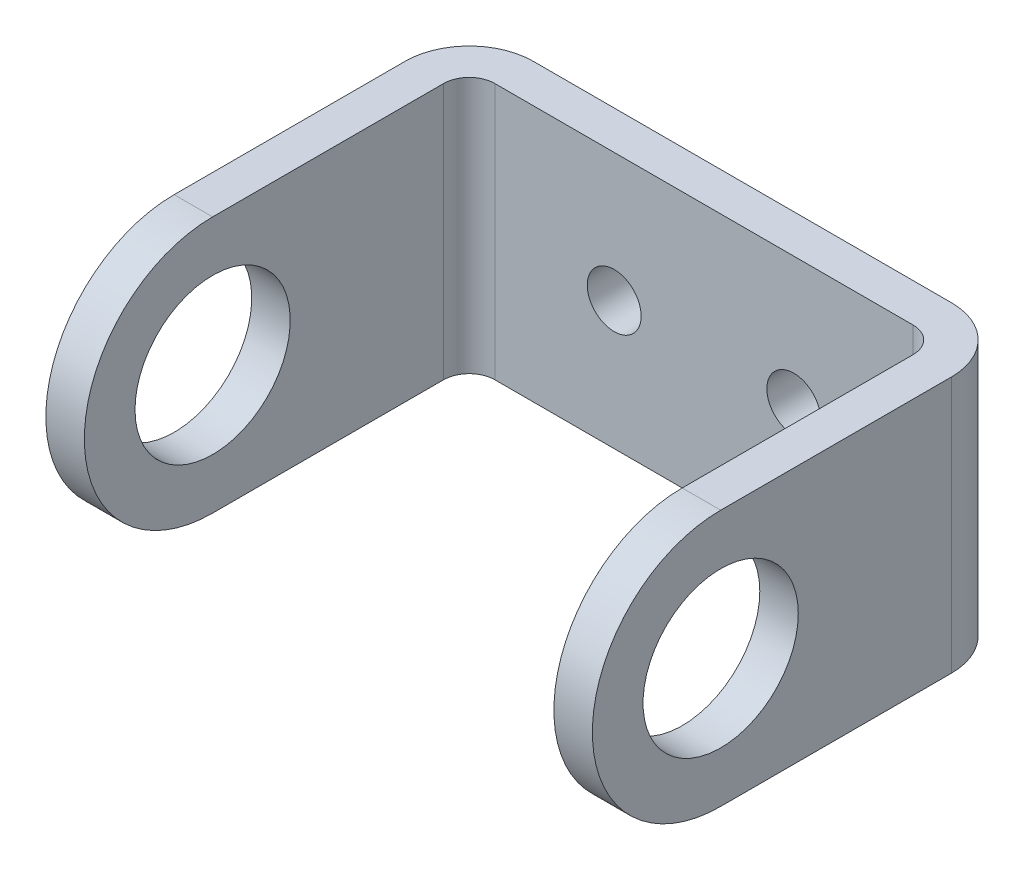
ISO-10303-21;
HEADER;
FILE_DESCRIPTION(('STEP AP214'),'2;1');
FILE_NAME('part.step','',(''),(''),'','','');
FILE_SCHEMA(('AUTOMOTIVE_DESIGN { 1 0 10303 214 1 1 1 1 }'));
ENDSEC;
DATA;
#1=APPLICATION_CONTEXT('core data for automotive mechanical design processes');
#2=APPLICATION_PROTOCOL_DEFINITION('international standard','automotive_design',2000,#1);
#3=PRODUCT_CONTEXT('',#1,'mechanical');
#4=PRODUCT('Part','Part','',(#3));
#5=PRODUCT_RELATED_PRODUCT_CATEGORY('part','',(#4));
#6=PRODUCT_DEFINITION_FORMATION('','',#4);
#7=PRODUCT_DEFINITION_CONTEXT('part definition',#1,'design');
#8=PRODUCT_DEFINITION('design','',#6,#7);
#9=PRODUCT_DEFINITION_SHAPE('','',#8);
#10=(LENGTH_UNIT() NAMED_UNIT(*) SI_UNIT(.MILLI.,.METRE.));
#11=(NAMED_UNIT(*) PLANE_ANGLE_UNIT() SI_UNIT($,.RADIAN.));
#12=(NAMED_UNIT(*) SI_UNIT($,.STERADIAN.) SOLID_ANGLE_UNIT());
#13=UNCERTAINTY_MEASURE_WITH_UNIT(LENGTH_MEASURE(1.E-05),#10,'distance_accuracy_value','');
#14=(GEOMETRIC_REPRESENTATION_CONTEXT(3) GLOBAL_UNCERTAINTY_ASSIGNED_CONTEXT((#13)) GLOBAL_UNIT_ASSIGNED_CONTEXT((#10,
#11,#12)) REPRESENTATION_CONTEXT('',''));
#15=CARTESIAN_POINT('',(0.,0.,0.));
#16=DIRECTION('',(0.,0.,1.));
#17=DIRECTION('',(1.,0.,0.));
#18=AXIS2_PLACEMENT_3D('',#15,#16,#17);
#19=CARTESIAN_POINT('',(18.3011064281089,0.,20.0011063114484));
#20=DIRECTION('',(-1.,0.,0.));
#21=DIRECTION('',(0.,0.,1.));
#22=AXIS2_PLACEMENT_3D('',#19,#20,#21);
#23=PLANE('',#22);
#24=CARTESIAN_POINT('',(18.3011064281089,0.,20.0011064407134));
#25=DIRECTION('',(1.,0.,0.));
#26=DIRECTION('',(0.,0.,-1.));
#27=AXIS2_PLACEMENT_3D('',#24,#25,#26);
#28=CIRCLE('',#27,6.05);
#29=CARTESIAN_POINT('',(18.3011064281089,0.,13.9511064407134));
#30=VERTEX_POINT('',#29);
#31=EDGE_CURVE('E254',#30,#30,#28,.T.);
#32=ORIENTED_EDGE('',*,*,#31,.T.);
#33=EDGE_LOOP('',(#32));
#34=FACE_BOUND('',#33,.T.);
#35=DIRECTION('',(0.,1.,0.));
#36=VECTOR('',#35,1.);
#37=CARTESIAN_POINT('',(18.301106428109,0.,2.));
#38=LINE('',#37,#36);
#39=CARTESIAN_POINT('',(18.301106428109,-10.,2.));
#40=VERTEX_POINT('',#39);
#41=CARTESIAN_POINT('',(18.301106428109,10.,2.));
#42=VERTEX_POINT('',#41);
#43=EDGE_CURVE('E142',#40,#42,#38,.T.);
#44=ORIENTED_EDGE('',*,*,#43,.F.);
#45=DIRECTION('',(0.,0.,1.));
#46=VECTOR('',#45,1.);
#47=CARTESIAN_POINT('',(18.3011064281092,-10.,-59.5988935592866));
#48=LINE('',#47,#46);
#49=CARTESIAN_POINT('',(18.3011064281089,-10.,20.0011064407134));
#50=VERTEX_POINT('',#49);
#51=EDGE_CURVE('E11',#40,#50,#48,.T.);
#52=ORIENTED_EDGE('',*,*,#51,.T.);
#53=CARTESIAN_POINT('',(18.3011064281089,0.,20.0011063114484));
#54=DIRECTION('',(-1.,0.,0.));
#55=DIRECTION('',(0.,0.,1.));
#56=AXIS2_PLACEMENT_3D('',#53,#54,#55);
#57=CIRCLE('',#56,10.);
#58=CARTESIAN_POINT('',(18.3011064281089,10.,20.0011064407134));
#59=VERTEX_POINT('',#58);
#60=EDGE_CURVE('E40',#50,#59,#57,.T.);
#61=ORIENTED_EDGE('',*,*,#60,.T.);
#62=DIRECTION('',(0.,0.,-1.));
#63=VECTOR('',#62,1.);
#64=CARTESIAN_POINT('',(18.3011064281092,10.,-59.5988935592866));
#65=LINE('',#64,#63);
#66=EDGE_CURVE('E21',#59,#42,#65,.T.);
#67=ORIENTED_EDGE('',*,*,#66,.T.);
#68=EDGE_LOOP('',(#44,#52,#61,#67));
#69=FACE_BOUND('',#68,.T.);
#70=ADVANCED_FACE('F17',(#34,#69),#23,.T.);
#71=CARTESIAN_POINT('',(21.3011064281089,0.,20.0011063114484));
#72=DIRECTION('',(-1.,0.,0.));
#73=DIRECTION('',(0.,0.,1.));
#74=AXIS2_PLACEMENT_3D('',#71,#72,#73);
#75=PLANE('',#74);
#76=CARTESIAN_POINT('',(21.3011064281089,0.,20.0011064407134));
#77=DIRECTION('',(1.,0.,0.));
#78=DIRECTION('',(0.,0.,-1.));
#79=AXIS2_PLACEMENT_3D('',#76,#77,#78);
#80=CIRCLE('',#79,6.05);
#81=CARTESIAN_POINT('',(21.3011064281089,0.,13.9511064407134));
#82=VERTEX_POINT('',#81);
#83=EDGE_CURVE('E256',#82,#82,#80,.T.);
#84=ORIENTED_EDGE('',*,*,#83,.F.);
#85=EDGE_LOOP('',(#84));
#86=FACE_BOUND('',#85,.T.);
#87=DIRECTION('',(0.,0.,1.));
#88=VECTOR('',#87,1.);
#89=CARTESIAN_POINT('',(21.3011064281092,-10.,-59.5988935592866));
#90=LINE('',#89,#88);
#91=CARTESIAN_POINT('',(21.301106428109,-10.,2.));
#92=VERTEX_POINT('',#91);
#93=CARTESIAN_POINT('',(21.3011064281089,-10.,20.0011064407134));
#94=VERTEX_POINT('',#93);
#95=EDGE_CURVE('E172',#92,#94,#90,.T.);
#96=ORIENTED_EDGE('',*,*,#95,.F.);
#97=DIRECTION('',(0.,1.,0.));
#98=VECTOR('',#97,1.);
#99=CARTESIAN_POINT('',(21.301106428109,0.,2.));
#100=LINE('',#99,#98);
#101=CARTESIAN_POINT('',(21.301106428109,10.,2.));
#102=VERTEX_POINT('',#101);
#103=EDGE_CURVE('E147',#92,#102,#100,.T.);
#104=ORIENTED_EDGE('',*,*,#103,.T.);
#105=DIRECTION('',(0.,0.,-1.));
#106=VECTOR('',#105,1.);
#107=CARTESIAN_POINT('',(21.3011064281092,10.,-59.5988935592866));
#108=LINE('',#107,#106);
#109=CARTESIAN_POINT('',(21.3011064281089,10.,20.0011064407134));
#110=VERTEX_POINT('',#109);
#111=EDGE_CURVE('E170',#110,#102,#108,.T.);
#112=ORIENTED_EDGE('',*,*,#111,.F.);
#113=CARTESIAN_POINT('',(21.3011064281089,0.,20.0011063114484));
#114=DIRECTION('',(-1.,0.,0.));
#115=DIRECTION('',(0.,0.,1.));
#116=AXIS2_PLACEMENT_3D('',#113,#114,#115);
#117=CIRCLE('',#116,10.);
#118=EDGE_CURVE('E278',#94,#110,#117,.T.);
#119=ORIENTED_EDGE('',*,*,#118,.F.);
#120=EDGE_LOOP('',(#96,#104,#112,#119));
#121=FACE_BOUND('',#120,.T.);
#122=ADVANCED_FACE('F332',(#86,#121),#75,.F.);
#123=CARTESIAN_POINT('',(16.3011064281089,20.957711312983,2.));
#124=DIRECTION('',(0.,-1.,0.));
#125=DIRECTION('',(1.,0.,0.));
#126=AXIS2_PLACEMENT_3D('',#123,#124,#125);
#127=CYLINDRICAL_SURFACE('',#126,2.);
#128=CARTESIAN_POINT('',(16.301106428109,10.,2.));
#129=DIRECTION('',(0.,-1.,0.));
#130=DIRECTION('',(1.,0.,0.));
#131=AXIS2_PLACEMENT_3D('',#128,#129,#130);
#132=CIRCLE('',#131,2.);
#133=CARTESIAN_POINT('',(16.301106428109,10.,0.));
#134=VERTEX_POINT('',#133);
#135=EDGE_CURVE('E162',#134,#42,#132,.T.);
#136=ORIENTED_EDGE('',*,*,#135,.F.);
#137=DIRECTION('',(0.,1.,0.));
#138=VECTOR('',#137,1.);
#139=CARTESIAN_POINT('',(16.301106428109,0.,0.));
#140=LINE('',#139,#138);
#141=CARTESIAN_POINT('',(16.301106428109,-10.,0.));
#142=VERTEX_POINT('',#141);
#143=EDGE_CURVE('E151',#142,#134,#140,.T.);
#144=ORIENTED_EDGE('',*,*,#143,.F.);
#145=CARTESIAN_POINT('',(16.301106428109,-10.,2.));
#146=DIRECTION('',(0.,1.,0.));
#147=DIRECTION('',(1.,0.,0.));
#148=AXIS2_PLACEMENT_3D('',#145,#146,#147);
#149=CIRCLE('',#148,2.);
#150=EDGE_CURVE('E137',#40,#142,#149,.T.);
#151=ORIENTED_EDGE('',*,*,#150,.F.);
#152=ORIENTED_EDGE('',*,*,#43,.T.);
#153=EDGE_LOOP('',(#136,#144,#151,#152));
#154=FACE_BOUND('',#153,.T.);
#155=ADVANCED_FACE('F149',(#154),#127,.F.);
#156=CARTESIAN_POINT('',(16.3011064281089,20.957711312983,2.));
#157=DIRECTION('',(0.,-1.,0.));
#158=DIRECTION('',(1.,0.,0.));
#159=AXIS2_PLACEMENT_3D('',#156,#157,#158);
#160=CYLINDRICAL_SURFACE('',#159,5.);
#161=CARTESIAN_POINT('',(16.301106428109,10.,2.));
#162=DIRECTION('',(0.,-1.,0.));
#163=DIRECTION('',(-1.,0.,0.));
#164=AXIS2_PLACEMENT_3D('',#161,#162,#163);
#165=CIRCLE('',#164,5.);
#166=CARTESIAN_POINT('',(16.3011064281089,10.,-3.));
#167=VERTEX_POINT('',#166);
#168=EDGE_CURVE('E169',#167,#102,#165,.T.);
#169=ORIENTED_EDGE('',*,*,#168,.T.);
#170=ORIENTED_EDGE('',*,*,#103,.F.);
#171=CARTESIAN_POINT('',(16.301106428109,-10.,2.));
#172=DIRECTION('',(0.,1.,0.));
#173=DIRECTION('',(0.,0.,-1.));
#174=AXIS2_PLACEMENT_3D('',#171,#172,#173);
#175=CIRCLE('',#174,5.);
#176=CARTESIAN_POINT('',(16.301106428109,-10.,-3.));
#177=VERTEX_POINT('',#176);
#178=EDGE_CURVE('E154',#92,#177,#175,.T.);
#179=ORIENTED_EDGE('',*,*,#178,.T.);
#180=DIRECTION('',(0.,1.,0.));
#181=VECTOR('',#180,1.);
#182=CARTESIAN_POINT('',(16.301106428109,0.,-3.));
#183=LINE('',#182,#181);
#184=EDGE_CURVE('E194',#177,#167,#183,.T.);
#185=ORIENTED_EDGE('',*,*,#184,.T.);
#186=EDGE_LOOP('',(#169,#170,#179,#185));
#187=FACE_BOUND('',#186,.T.);
#188=ADVANCED_FACE('F19',(#187),#160,.T.);
#189=CARTESIAN_POINT('',(-18.3011064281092,0.,-59.5988934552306));
#190=DIRECTION('',(1.,0.,0.));
#191=DIRECTION('',(0.,0.,-1.));
#192=AXIS2_PLACEMENT_3D('',#189,#190,#191);
#193=PLANE('',#192);
#194=CARTESIAN_POINT('',(-18.3011064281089,0.,20.0011064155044));
#195=DIRECTION('',(-1.,0.,0.));
#196=DIRECTION('',(0.,0.,1.));
#197=AXIS2_PLACEMENT_3D('',#194,#195,#196);
#198=CIRCLE('',#197,6.05);
#199=CARTESIAN_POINT('',(-18.3011064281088,0.,26.0511064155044));
#200=VERTEX_POINT('',#199);
#201=EDGE_CURVE('E260',#200,#200,#198,.T.);
#202=ORIENTED_EDGE('',*,*,#201,.T.);
#203=EDGE_LOOP('',(#202));
#204=FACE_BOUND('',#203,.T.);
#205=DIRECTION('',(0.,0.,-1.));
#206=VECTOR('',#205,1.);
#207=CARTESIAN_POINT('',(-18.3011064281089,-10.,20.0011064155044));
#208=LINE('',#207,#206);
#209=CARTESIAN_POINT('',(-18.3011064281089,-10.,20.0011064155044));
#210=VERTEX_POINT('',#209);
#211=CARTESIAN_POINT('',(-18.301106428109,-10.,2.));
#212=VERTEX_POINT('',#211);
#213=EDGE_CURVE('E164',#210,#212,#208,.T.);
#214=ORIENTED_EDGE('',*,*,#213,.T.);
#215=DIRECTION('',(0.,1.,0.));
#216=VECTOR('',#215,1.);
#217=CARTESIAN_POINT('',(-18.301106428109,0.,2.));
#218=LINE('',#217,#216);
#219=CARTESIAN_POINT('',(-18.301106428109,10.,2.));
#220=VERTEX_POINT('',#219);
#221=EDGE_CURVE('E218',#212,#220,#218,.T.);
#222=ORIENTED_EDGE('',*,*,#221,.T.);
#223=DIRECTION('',(0.,0.,1.));
#224=VECTOR('',#223,1.);
#225=CARTESIAN_POINT('',(-18.3011064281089,10.,20.0011064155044));
#226=LINE('',#225,#224);
#227=CARTESIAN_POINT('',(-18.3011064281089,10.,20.0011064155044));
#228=VERTEX_POINT('',#227);
#229=EDGE_CURVE('E155',#220,#228,#226,.T.);
#230=ORIENTED_EDGE('',*,*,#229,.T.);
#231=CARTESIAN_POINT('',(-18.3011064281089,0.,20.0011063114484));
#232=DIRECTION('',(1.,0.,0.));
#233=DIRECTION('',(0.,0.,-1.));
#234=AXIS2_PLACEMENT_3D('',#231,#232,#233);
#235=CIRCLE('',#234,10.);
#236=EDGE_CURVE('E214',#228,#210,#235,.T.);
#237=ORIENTED_EDGE('',*,*,#236,.T.);
#238=EDGE_LOOP('',(#214,#222,#230,#237));
#239=FACE_BOUND('',#238,.T.);
#240=ADVANCED_FACE('F321',(#204,#239),#193,.T.);
#241=CARTESIAN_POINT('',(-21.3011064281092,0.,-59.5988934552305));
#242=DIRECTION('',(1.,0.,0.));
#243=DIRECTION('',(0.,0.,-1.));
#244=AXIS2_PLACEMENT_3D('',#241,#242,#243);
#245=PLANE('',#244);
#246=CARTESIAN_POINT('',(-21.3011064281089,0.,20.0011064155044));
#247=DIRECTION('',(-1.,0.,0.));
#248=DIRECTION('',(0.,0.,1.));
#249=AXIS2_PLACEMENT_3D('',#246,#247,#248);
#250=CIRCLE('',#249,6.05);
#251=CARTESIAN_POINT('',(-21.3011064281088,0.,26.0511064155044));
#252=VERTEX_POINT('',#251);
#253=EDGE_CURVE('E271',#252,#252,#250,.T.);
#254=ORIENTED_EDGE('',*,*,#253,.F.);
#255=EDGE_LOOP('',(#254));
#256=FACE_BOUND('',#255,.T.);
#257=DIRECTION('',(0.,1.,0.));
#258=VECTOR('',#257,1.);
#259=CARTESIAN_POINT('',(-21.301106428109,0.,2.));
#260=LINE('',#259,#258);
#261=CARTESIAN_POINT('',(-21.3011064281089,-10.,2.));
#262=VERTEX_POINT('',#261);
#263=CARTESIAN_POINT('',(-21.3011064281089,10.,2.00000000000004));
#264=VERTEX_POINT('',#263);
#265=EDGE_CURVE('E264',#262,#264,#260,.T.);
#266=ORIENTED_EDGE('',*,*,#265,.F.);
#267=DIRECTION('',(0.,0.,-1.));
#268=VECTOR('',#267,1.);
#269=CARTESIAN_POINT('',(-21.3011064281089,-10.,20.0011064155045));
#270=LINE('',#269,#268);
#271=CARTESIAN_POINT('',(-21.3011064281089,-10.,20.0011064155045));
#272=VERTEX_POINT('',#271);
#273=EDGE_CURVE('E225',#272,#262,#270,.T.);
#274=ORIENTED_EDGE('',*,*,#273,.F.);
#275=CARTESIAN_POINT('',(-21.3011064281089,0.,20.0011063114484));
#276=DIRECTION('',(1.,0.,0.));
#277=DIRECTION('',(0.,0.,-1.));
#278=AXIS2_PLACEMENT_3D('',#275,#276,#277);
#279=CIRCLE('',#278,10.);
#280=CARTESIAN_POINT('',(-21.3011064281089,10.,20.0011064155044));
#281=VERTEX_POINT('',#280);
#282=EDGE_CURVE('E203',#281,#272,#279,.T.);
#283=ORIENTED_EDGE('',*,*,#282,.F.);
#284=DIRECTION('',(0.,0.,1.));
#285=VECTOR('',#284,1.);
#286=CARTESIAN_POINT('',(-21.3011064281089,10.,20.0011064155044));
#287=LINE('',#286,#285);
#288=EDGE_CURVE('E227',#264,#281,#287,.T.);
#289=ORIENTED_EDGE('',*,*,#288,.F.);
#290=EDGE_LOOP('',(#266,#274,#283,#289));
#291=FACE_BOUND('',#290,.T.);
#292=ADVANCED_FACE('F312',(#256,#291),#245,.F.);
#293=CARTESIAN_POINT('',(-21.3011064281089,0.,20.0011063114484));
#294=DIRECTION('',(1.,0.,0.));
#295=DIRECTION('',(0.,0.,-1.));
#296=AXIS2_PLACEMENT_3D('',#293,#294,#295);
#297=CYLINDRICAL_SURFACE('',#296,10.);
#298=ORIENTED_EDGE('',*,*,#236,.F.);
#299=DIRECTION('',(1.,0.,0.));
#300=VECTOR('',#299,1.);
#301=CARTESIAN_POINT('',(-21.3011064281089,10.,20.0011064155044));
#302=LINE('',#301,#300);
#303=EDGE_CURVE('E208',#281,#228,#302,.T.);
#304=ORIENTED_EDGE('',*,*,#303,.F.);
#305=ORIENTED_EDGE('',*,*,#282,.T.);
#306=DIRECTION('',(1.,0.,0.));
#307=VECTOR('',#306,1.);
#308=CARTESIAN_POINT('',(-21.3011064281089,-10.,20.0011064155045));
#309=LINE('',#308,#307);
#310=EDGE_CURVE('E207',#272,#210,#309,.T.);
#311=ORIENTED_EDGE('',*,*,#310,.T.);
#312=EDGE_LOOP('',(#298,#304,#305,#311));
#313=FACE_BOUND('',#312,.T.);
#314=ADVANCED_FACE('F316',(#313),#297,.T.);
#315=CARTESIAN_POINT('',(-16.3011064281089,-20.957711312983,2.));
#316=DIRECTION('',(0.,1.,0.));
#317=DIRECTION('',(-1.,0.,0.));
#318=AXIS2_PLACEMENT_3D('',#315,#316,#317);
#319=CYLINDRICAL_SURFACE('',#318,2.);
#320=CARTESIAN_POINT('',(-16.3011064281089,10.,2.));
#321=DIRECTION('',(0.,-1.,0.));
#322=DIRECTION('',(-1.,0.,0.));
#323=AXIS2_PLACEMENT_3D('',#320,#321,#322);
#324=CIRCLE('',#323,2.);
#325=CARTESIAN_POINT('',(-16.3011064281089,10.,0.));
#326=VERTEX_POINT('',#325);
#327=EDGE_CURVE('E209',#220,#326,#324,.T.);
#328=ORIENTED_EDGE('',*,*,#327,.F.);
#329=ORIENTED_EDGE('',*,*,#221,.F.);
#330=CARTESIAN_POINT('',(-16.3011064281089,-10.,2.));
#331=DIRECTION('',(0.,1.,0.));
#332=DIRECTION('',(-1.,0.,0.));
#333=AXIS2_PLACEMENT_3D('',#330,#331,#332);
#334=CIRCLE('',#333,2.);
#335=CARTESIAN_POINT('',(-16.3011064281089,-10.,0.));
#336=VERTEX_POINT('',#335);
#337=EDGE_CURVE('E202',#336,#212,#334,.T.);
#338=ORIENTED_EDGE('',*,*,#337,.F.);
#339=DIRECTION('',(0.,1.,0.));
#340=VECTOR('',#339,1.);
#341=CARTESIAN_POINT('',(-16.3011064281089,0.,0.));
#342=LINE('',#341,#340);
#343=EDGE_CURVE('E190',#336,#326,#342,.T.);
#344=ORIENTED_EDGE('',*,*,#343,.T.);
#345=EDGE_LOOP('',(#328,#329,#338,#344));
#346=FACE_BOUND('',#345,.T.);
#347=ADVANCED_FACE('F323',(#346),#319,.F.);
#348=CARTESIAN_POINT('',(-16.3011064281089,-20.957711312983,2.));
#349=DIRECTION('',(0.,1.,0.));
#350=DIRECTION('',(-1.,0.,0.));
#351=AXIS2_PLACEMENT_3D('',#348,#349,#350);
#352=CYLINDRICAL_SURFACE('',#351,5.);
#353=CARTESIAN_POINT('',(-16.3011064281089,10.,2.));
#354=DIRECTION('',(0.,-1.,0.));
#355=DIRECTION('',(0.,0.,1.));
#356=AXIS2_PLACEMENT_3D('',#353,#354,#355);
#357=CIRCLE('',#356,5.);
#358=CARTESIAN_POINT('',(-16.3011064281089,10.,-3.));
#359=VERTEX_POINT('',#358);
#360=EDGE_CURVE('E212',#264,#359,#357,.T.);
#361=ORIENTED_EDGE('',*,*,#360,.T.);
#362=DIRECTION('',(0.,1.,0.));
#363=VECTOR('',#362,1.);
#364=CARTESIAN_POINT('',(-16.3011064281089,0.,-3.));
#365=LINE('',#364,#363);
#366=CARTESIAN_POINT('',(-16.3011064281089,-10.,-3.));
#367=VERTEX_POINT('',#366);
#368=EDGE_CURVE('E198',#367,#359,#365,.T.);
#369=ORIENTED_EDGE('',*,*,#368,.F.);
#370=CARTESIAN_POINT('',(-16.3011064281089,-10.,2.));
#371=DIRECTION('',(0.,1.,0.));
#372=DIRECTION('',(0.,0.,-1.));
#373=AXIS2_PLACEMENT_3D('',#370,#371,#372);
#374=CIRCLE('',#373,5.);
#375=EDGE_CURVE('E213',#367,#262,#374,.T.);
#376=ORIENTED_EDGE('',*,*,#375,.T.);
#377=ORIENTED_EDGE('',*,*,#265,.T.);
#378=EDGE_LOOP('',(#361,#369,#376,#377));
#379=FACE_BOUND('',#378,.T.);
#380=ADVANCED_FACE('F307',(#379),#352,.T.);
#381=CARTESIAN_POINT('',(39.7999998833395,0.,-3.));
#382=DIRECTION('',(0.,0.,1.));
#383=DIRECTION('',(1.,0.,0.));
#384=AXIS2_PLACEMENT_3D('',#381,#382,#383);
#385=PLANE('',#384);
#386=CARTESIAN_POINT('',(7.,0.,-3.));
#387=DIRECTION('',(0.,0.,1.));
#388=DIRECTION('',(1.,0.,0.));
#389=AXIS2_PLACEMENT_3D('',#386,#387,#388);
#390=CIRCLE('',#389,2.1);
#391=CARTESIAN_POINT('',(9.1,0.,-3.));
#392=VERTEX_POINT('',#391);
#393=EDGE_CURVE('E243',#392,#392,#390,.T.);
#394=ORIENTED_EDGE('',*,*,#393,.T.);
#395=EDGE_LOOP('',(#394));
#396=FACE_BOUND('',#395,.T.);
#397=CARTESIAN_POINT('',(-7.,0.,-3.));
#398=DIRECTION('',(0.,0.,1.));
#399=DIRECTION('',(1.,0.,0.));
#400=AXIS2_PLACEMENT_3D('',#397,#398,#399);
#401=CIRCLE('',#400,2.1);
#402=CARTESIAN_POINT('',(-4.9,0.,-3.));
#403=VERTEX_POINT('',#402);
#404=EDGE_CURVE('E540',#403,#403,#401,.T.);
#405=ORIENTED_EDGE('',*,*,#404,.T.);
#406=EDGE_LOOP('',(#405));
#407=FACE_BOUND('',#406,.T.);
#408=ORIENTED_EDGE('',*,*,#184,.F.);
#409=DIRECTION('',(1.,0.,0.));
#410=VECTOR('',#409,1.);
#411=CARTESIAN_POINT('',(-39.7999999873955,-10.,-3.));
#412=LINE('',#411,#410);
#413=EDGE_CURVE('E287',#367,#177,#412,.T.);
#414=ORIENTED_EDGE('',*,*,#413,.F.);
#415=ORIENTED_EDGE('',*,*,#368,.T.);
#416=DIRECTION('',(-1.,0.,0.));
#417=VECTOR('',#416,1.);
#418=CARTESIAN_POINT('',(-39.7999999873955,10.,-3.));
#419=LINE('',#418,#417);
#420=EDGE_CURVE('E251',#167,#359,#419,.T.);
#421=ORIENTED_EDGE('',*,*,#420,.F.);
#422=EDGE_LOOP('',(#408,#414,#415,#421));
#423=FACE_BOUND('',#422,.T.);
#424=ADVANCED_FACE('F655',(#396,#407,#423),#385,.F.);
#425=CARTESIAN_POINT('',(39.7999998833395,0.,0.));
#426=DIRECTION('',(0.,0.,1.));
#427=DIRECTION('',(1.,0.,0.));
#428=AXIS2_PLACEMENT_3D('',#425,#426,#427);
#429=PLANE('',#428);
#430=CARTESIAN_POINT('',(7.,0.,0.));
#431=DIRECTION('',(0.,0.,1.));
#432=DIRECTION('',(1.,0.,0.));
#433=AXIS2_PLACEMENT_3D('',#430,#431,#432);
#434=CIRCLE('',#433,2.1);
#435=CARTESIAN_POINT('',(9.1,0.,0.));
#436=VERTEX_POINT('',#435);
#437=EDGE_CURVE('E247',#436,#436,#434,.T.);
#438=ORIENTED_EDGE('',*,*,#437,.F.);
#439=EDGE_LOOP('',(#438));
#440=FACE_BOUND('',#439,.T.);
#441=CARTESIAN_POINT('',(-7.,0.,0.));
#442=DIRECTION('',(0.,0.,1.));
#443=DIRECTION('',(1.,0.,0.));
#444=AXIS2_PLACEMENT_3D('',#441,#442,#443);
#445=CIRCLE('',#444,2.1);
#446=CARTESIAN_POINT('',(-4.9,0.,0.));
#447=VERTEX_POINT('',#446);
#448=EDGE_CURVE('E248',#447,#447,#445,.T.);
#449=ORIENTED_EDGE('',*,*,#448,.F.);
#450=EDGE_LOOP('',(#449));
#451=FACE_BOUND('',#450,.T.);
#452=DIRECTION('',(1.,0.,0.));
#453=VECTOR('',#452,1.);
#454=CARTESIAN_POINT('',(-39.7999999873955,-10.,0.));
#455=LINE('',#454,#453);
#456=EDGE_CURVE('E290',#336,#142,#455,.T.);
#457=ORIENTED_EDGE('',*,*,#456,.T.);
#458=ORIENTED_EDGE('',*,*,#143,.T.);
#459=DIRECTION('',(-1.,0.,0.));
#460=VECTOR('',#459,1.);
#461=CARTESIAN_POINT('',(-39.7999999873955,10.,0.));
#462=LINE('',#461,#460);
#463=EDGE_CURVE('E293',#134,#326,#462,.T.);
#464=ORIENTED_EDGE('',*,*,#463,.T.);
#465=ORIENTED_EDGE('',*,*,#343,.F.);
#466=EDGE_LOOP('',(#457,#458,#464,#465));
#467=FACE_BOUND('',#466,.T.);
#468=ADVANCED_FACE('F327',(#440,#451,#467),#429,.T.);
#469=CARTESIAN_POINT('',(-39.7999999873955,10.,-3.));
#470=DIRECTION('',(0.,1.,0.));
#471=DIRECTION('',(1.,0.,0.));
#472=AXIS2_PLACEMENT_3D('',#469,#470,#471);
#473=PLANE('',#472);
#474=ORIENTED_EDGE('',*,*,#463,.F.);
#475=ORIENTED_EDGE('',*,*,#135,.T.);
#476=ORIENTED_EDGE('',*,*,#66,.F.);
#477=DIRECTION('',(-1.,0.,0.));
#478=VECTOR('',#477,1.);
#479=CARTESIAN_POINT('',(21.3011064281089,10.,20.0011064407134));
#480=LINE('',#479,#478);
#481=EDGE_CURVE('E146',#110,#59,#480,.T.);
#482=ORIENTED_EDGE('',*,*,#481,.F.);
#483=ORIENTED_EDGE('',*,*,#111,.T.);
#484=ORIENTED_EDGE('',*,*,#168,.F.);
#485=ORIENTED_EDGE('',*,*,#420,.T.);
#486=ORIENTED_EDGE('',*,*,#360,.F.);
#487=ORIENTED_EDGE('',*,*,#288,.T.);
#488=ORIENTED_EDGE('',*,*,#303,.T.);
#489=ORIENTED_EDGE('',*,*,#229,.F.);
#490=ORIENTED_EDGE('',*,*,#327,.T.);
#491=EDGE_LOOP('',(#474,#475,#476,#482,#483,#484,#485,#486,#487,#488,#489,#490));
#492=FACE_BOUND('',#491,.T.);
#493=ADVANCED_FACE('F318',(#492),#473,.T.);
#494=CARTESIAN_POINT('',(-39.7999999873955,-10.,-3.));
#495=DIRECTION('',(0.,-1.,0.));
#496=DIRECTION('',(0.,0.,-1.));
#497=AXIS2_PLACEMENT_3D('',#494,#495,#496);
#498=PLANE('',#497);
#499=ORIENTED_EDGE('',*,*,#413,.T.);
#500=ORIENTED_EDGE('',*,*,#178,.F.);
#501=ORIENTED_EDGE('',*,*,#95,.T.);
#502=DIRECTION('',(-1.,0.,0.));
#503=VECTOR('',#502,1.);
#504=CARTESIAN_POINT('',(21.3011064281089,-10.,20.0011064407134));
#505=LINE('',#504,#503);
#506=EDGE_CURVE('E140',#94,#50,#505,.T.);
#507=ORIENTED_EDGE('',*,*,#506,.T.);
#508=ORIENTED_EDGE('',*,*,#51,.F.);
#509=ORIENTED_EDGE('',*,*,#150,.T.);
#510=ORIENTED_EDGE('',*,*,#456,.F.);
#511=ORIENTED_EDGE('',*,*,#337,.T.);
#512=ORIENTED_EDGE('',*,*,#213,.F.);
#513=ORIENTED_EDGE('',*,*,#310,.F.);
#514=ORIENTED_EDGE('',*,*,#273,.T.);
#515=ORIENTED_EDGE('',*,*,#375,.F.);
#516=EDGE_LOOP('',(#499,#500,#501,#507,#508,#509,#510,#511,#512,#513,#514,#515));
#517=FACE_BOUND('',#516,.T.);
#518=ADVANCED_FACE('F134',(#517),#498,.T.);
#519=CARTESIAN_POINT('',(21.3011064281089,0.,20.0011063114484));
#520=DIRECTION('',(-1.,0.,0.));
#521=DIRECTION('',(0.,0.,1.));
#522=AXIS2_PLACEMENT_3D('',#519,#520,#521);
#523=CYLINDRICAL_SURFACE('',#522,10.);
#524=ORIENTED_EDGE('',*,*,#118,.T.);
#525=ORIENTED_EDGE('',*,*,#481,.T.);
#526=ORIENTED_EDGE('',*,*,#60,.F.);
#527=ORIENTED_EDGE('',*,*,#506,.F.);
#528=EDGE_LOOP('',(#524,#525,#526,#527));
#529=FACE_BOUND('',#528,.T.);
#530=ADVANCED_FACE('F329',(#529),#523,.T.);
#531=CARTESIAN_POINT('',(-18.3011064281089,0.,20.0011064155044));
#532=DIRECTION('',(-1.,0.,0.));
#533=DIRECTION('',(0.,0.,1.));
#534=AXIS2_PLACEMENT_3D('',#531,#532,#533);
#535=CYLINDRICAL_SURFACE('',#534,6.05);
#536=ORIENTED_EDGE('',*,*,#253,.T.);
#537=EDGE_LOOP('',(#536));
#538=FACE_BOUND('',#537,.T.);
#539=ORIENTED_EDGE('',*,*,#201,.F.);
#540=EDGE_LOOP('',(#539));
#541=FACE_BOUND('',#540,.T.);
#542=ADVANCED_FACE('F597',(#538,#541),#535,.F.);
#543=CARTESIAN_POINT('',(18.3011064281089,0.,20.0011064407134));
#544=DIRECTION('',(1.,0.,0.));
#545=DIRECTION('',(0.,0.,-1.));
#546=AXIS2_PLACEMENT_3D('',#543,#544,#545);
#547=CYLINDRICAL_SURFACE('',#546,6.05);
#548=ORIENTED_EDGE('',*,*,#83,.T.);
#549=EDGE_LOOP('',(#548));
#550=FACE_BOUND('',#549,.T.);
#551=ORIENTED_EDGE('',*,*,#31,.F.);
#552=EDGE_LOOP('',(#551));
#553=FACE_BOUND('',#552,.T.);
#554=ADVANCED_FACE('F585',(#550,#553),#547,.F.);
#555=CARTESIAN_POINT('',(7.,0.,-3.));
#556=DIRECTION('',(0.,0.,1.));
#557=DIRECTION('',(1.,0.,0.));
#558=AXIS2_PLACEMENT_3D('',#555,#556,#557);
#559=CYLINDRICAL_SURFACE('',#558,2.1);
#560=ORIENTED_EDGE('',*,*,#437,.T.);
#561=EDGE_LOOP('',(#560));
#562=FACE_BOUND('',#561,.T.);
#563=ORIENTED_EDGE('',*,*,#393,.F.);
#564=EDGE_LOOP('',(#563));
#565=FACE_BOUND('',#564,.T.);
#566=ADVANCED_FACE('F572',(#562,#565),#559,.F.);
#567=CARTESIAN_POINT('',(-7.,0.,-3.));
#568=DIRECTION('',(0.,0.,1.));
#569=DIRECTION('',(1.,0.,0.));
#570=AXIS2_PLACEMENT_3D('',#567,#568,#569);
#571=CYLINDRICAL_SURFACE('',#570,2.1);
#572=ORIENTED_EDGE('',*,*,#448,.T.);
#573=EDGE_LOOP('',(#572));
#574=FACE_BOUND('',#573,.T.);
#575=ORIENTED_EDGE('',*,*,#404,.F.);
#576=EDGE_LOOP('',(#575));
#577=FACE_BOUND('',#576,.T.);
#578=ADVANCED_FACE('F566',(#574,#577),#571,.F.);
#579=CLOSED_SHELL('',(#70,#122,#155,#188,#240,#292,#314,#347,#380,#424,#468,#493,#518,#530,#542,
#554,#566,#578));
#580=MANIFOLD_SOLID_BREP('B1',#579);
#581=ADVANCED_BREP_SHAPE_REPRESENTATION('',(#18,#580),#14);
#582=SHAPE_DEFINITION_REPRESENTATION(#9,#581);
ENDSEC;
END-ISO-10303-21;
